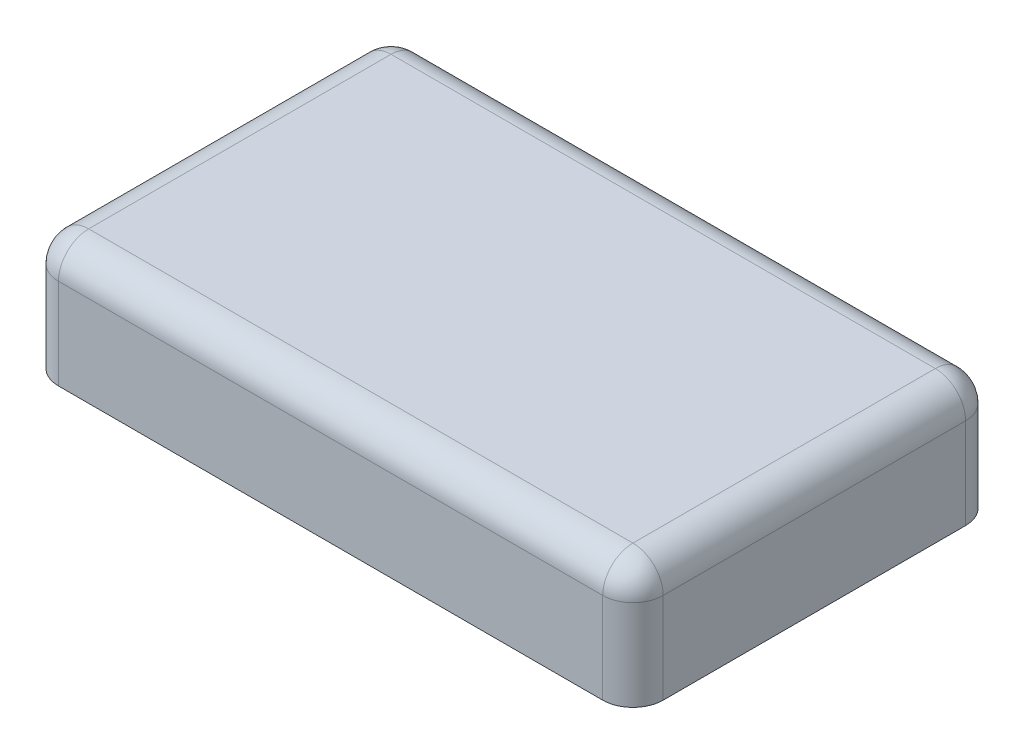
ISO-10303-21;
HEADER;
FILE_DESCRIPTION(('STEP AP214'),'2;1');
FILE_NAME('part.step','',(''),(''),'','','');
FILE_SCHEMA(('AUTOMOTIVE_DESIGN { 1 0 10303 214 1 1 1 1 }'));
ENDSEC;
DATA;
#1=APPLICATION_CONTEXT('core data for automotive mechanical design processes');
#2=APPLICATION_PROTOCOL_DEFINITION('international standard','automotive_design',2000,#1);
#3=PRODUCT_CONTEXT('',#1,'mechanical');
#4=PRODUCT('Part','Part','',(#3));
#5=PRODUCT_RELATED_PRODUCT_CATEGORY('part','',(#4));
#6=PRODUCT_DEFINITION_FORMATION('','',#4);
#7=PRODUCT_DEFINITION_CONTEXT('part definition',#1,'design');
#8=PRODUCT_DEFINITION('design','',#6,#7);
#9=PRODUCT_DEFINITION_SHAPE('','',#8);
#10=(LENGTH_UNIT() NAMED_UNIT(*) SI_UNIT(.MILLI.,.METRE.));
#11=(NAMED_UNIT(*) PLANE_ANGLE_UNIT() SI_UNIT($,.RADIAN.));
#12=(NAMED_UNIT(*) SI_UNIT($,.STERADIAN.) SOLID_ANGLE_UNIT());
#13=UNCERTAINTY_MEASURE_WITH_UNIT(LENGTH_MEASURE(1.E-05),#10,'distance_accuracy_value','');
#14=(GEOMETRIC_REPRESENTATION_CONTEXT(3) GLOBAL_UNCERTAINTY_ASSIGNED_CONTEXT((#13)) GLOBAL_UNIT_ASSIGNED_CONTEXT((#10,
#11,#12)) REPRESENTATION_CONTEXT('',''));
#15=CARTESIAN_POINT('',(0.,0.,0.));
#16=DIRECTION('',(0.,0.,1.));
#17=DIRECTION('',(1.,0.,0.));
#18=AXIS2_PLACEMENT_3D('',#15,#16,#17);
#19=CARTESIAN_POINT('',(63.5,25.4,38.1));
#20=DIRECTION('',(-1.,0.,0.));
#21=DIRECTION('',(0.,0.,1.));
#22=AXIS2_PLACEMENT_3D('',#19,#20,#21);
#23=PLANE('',#22);
#24=DIRECTION('',(0.,-1.,0.));
#25=VECTOR('',#24,1.);
#26=CARTESIAN_POINT('',(63.5,25.4,-31.75));
#27=LINE('',#26,#25);
#28=CARTESIAN_POINT('',(63.5,0.,-31.75));
#29=VERTEX_POINT('',#28);
#30=CARTESIAN_POINT('',(63.5,19.05,-31.75));
#31=VERTEX_POINT('',#30);
#32=EDGE_CURVE('E120',#29,#31,#27,.F.);
#33=ORIENTED_EDGE('',*,*,#32,.T.);
#34=DIRECTION('',(0.,0.,-1.));
#35=VECTOR('',#34,1.);
#36=CARTESIAN_POINT('',(63.5,19.05,38.1));
#37=LINE('',#36,#35);
#38=CARTESIAN_POINT('',(63.5,19.05,31.75));
#39=VERTEX_POINT('',#38);
#40=EDGE_CURVE('E60',#31,#39,#37,.F.);
#41=ORIENTED_EDGE('',*,*,#40,.T.);
#42=DIRECTION('',(0.,-1.,0.));
#43=VECTOR('',#42,1.);
#44=CARTESIAN_POINT('',(63.5,25.4,31.75));
#45=LINE('',#44,#43);
#46=CARTESIAN_POINT('',(63.5,0.,31.75));
#47=VERTEX_POINT('',#46);
#48=EDGE_CURVE('E113',#39,#47,#45,.T.);
#49=ORIENTED_EDGE('',*,*,#48,.T.);
#50=DIRECTION('',(0.,0.,-1.));
#51=VECTOR('',#50,1.);
#52=CARTESIAN_POINT('',(63.5,0.,38.1));
#53=LINE('',#52,#51);
#54=EDGE_CURVE('E116',#47,#29,#53,.T.);
#55=ORIENTED_EDGE('',*,*,#54,.T.);
#56=EDGE_LOOP('',(#33,#41,#49,#55));
#57=FACE_BOUND('',#56,.T.);
#58=ADVANCED_FACE('F36',(#57),#23,.F.);
#59=CARTESIAN_POINT('',(-63.5,25.4,-38.1));
#60=DIRECTION('',(0.,0.,1.));
#61=DIRECTION('',(1.,0.,0.));
#62=AXIS2_PLACEMENT_3D('',#59,#60,#61);
#63=PLANE('',#62);
#64=DIRECTION('',(0.,-1.,0.));
#65=VECTOR('',#64,1.);
#66=CARTESIAN_POINT('',(-57.15,25.4,-38.1));
#67=LINE('',#66,#65);
#68=CARTESIAN_POINT('',(-57.15,0.,-38.1));
#69=VERTEX_POINT('',#68);
#70=CARTESIAN_POINT('',(-57.15,19.05,-38.1));
#71=VERTEX_POINT('',#70);
#72=EDGE_CURVE('E160',#69,#71,#67,.F.);
#73=ORIENTED_EDGE('',*,*,#72,.T.);
#74=DIRECTION('',(-1.,0.,0.));
#75=VECTOR('',#74,1.);
#76=CARTESIAN_POINT('',(-63.5,19.05,-38.1));
#77=LINE('',#76,#75);
#78=CARTESIAN_POINT('',(57.15,19.05,-38.1));
#79=VERTEX_POINT('',#78);
#80=EDGE_CURVE('E179',#71,#79,#77,.F.);
#81=ORIENTED_EDGE('',*,*,#80,.T.);
#82=DIRECTION('',(0.,-1.,0.));
#83=VECTOR('',#82,1.);
#84=CARTESIAN_POINT('',(57.15,25.4,-38.1));
#85=LINE('',#84,#83);
#86=CARTESIAN_POINT('',(57.15,0.,-38.1));
#87=VERTEX_POINT('',#86);
#88=EDGE_CURVE('E158',#79,#87,#85,.T.);
#89=ORIENTED_EDGE('',*,*,#88,.T.);
#90=DIRECTION('',(-1.,0.,0.));
#91=VECTOR('',#90,1.);
#92=CARTESIAN_POINT('',(-63.5,0.,-38.1));
#93=LINE('',#92,#91);
#94=EDGE_CURVE('E135',#87,#69,#93,.T.);
#95=ORIENTED_EDGE('',*,*,#94,.T.);
#96=EDGE_LOOP('',(#73,#81,#89,#95));
#97=FACE_BOUND('',#96,.T.);
#98=ADVANCED_FACE('F238',(#97),#63,.F.);
#99=CARTESIAN_POINT('',(-63.5,25.4,38.1));
#100=DIRECTION('',(1.,0.,0.));
#101=DIRECTION('',(0.,0.,-1.));
#102=AXIS2_PLACEMENT_3D('',#99,#100,#101);
#103=PLANE('',#102);
#104=DIRECTION('',(0.,-1.,0.));
#105=VECTOR('',#104,1.);
#106=CARTESIAN_POINT('',(-63.5,25.4,31.75));
#107=LINE('',#106,#105);
#108=CARTESIAN_POINT('',(-63.5,0.,31.75));
#109=VERTEX_POINT('',#108);
#110=CARTESIAN_POINT('',(-63.5,19.05,31.75));
#111=VERTEX_POINT('',#110);
#112=EDGE_CURVE('E153',#109,#111,#107,.F.);
#113=ORIENTED_EDGE('',*,*,#112,.T.);
#114=DIRECTION('',(0.,0.,1.));
#115=VECTOR('',#114,1.);
#116=CARTESIAN_POINT('',(-63.5,19.05,38.1));
#117=LINE('',#116,#115);
#118=CARTESIAN_POINT('',(-63.5,19.05,-31.75));
#119=VERTEX_POINT('',#118);
#120=EDGE_CURVE('E175',#111,#119,#117,.F.);
#121=ORIENTED_EDGE('',*,*,#120,.T.);
#122=DIRECTION('',(0.,-1.,0.));
#123=VECTOR('',#122,1.);
#124=CARTESIAN_POINT('',(-63.5,25.4,-31.75));
#125=LINE('',#124,#123);
#126=CARTESIAN_POINT('',(-63.5,0.,-31.75));
#127=VERTEX_POINT('',#126);
#128=EDGE_CURVE('E156',#119,#127,#125,.T.);
#129=ORIENTED_EDGE('',*,*,#128,.T.);
#130=DIRECTION('',(0.,0.,1.));
#131=VECTOR('',#130,1.);
#132=CARTESIAN_POINT('',(-63.5,0.,38.1));
#133=LINE('',#132,#131);
#134=EDGE_CURVE('E138',#127,#109,#133,.T.);
#135=ORIENTED_EDGE('',*,*,#134,.T.);
#136=EDGE_LOOP('',(#113,#121,#129,#135));
#137=FACE_BOUND('',#136,.T.);
#138=ADVANCED_FACE('F243',(#137),#103,.F.);
#139=CARTESIAN_POINT('',(-63.5,25.4,38.1));
#140=DIRECTION('',(0.,0.,-1.));
#141=DIRECTION('',(-1.,0.,0.));
#142=AXIS2_PLACEMENT_3D('',#139,#140,#141);
#143=PLANE('',#142);
#144=DIRECTION('',(0.,-1.,0.));
#145=VECTOR('',#144,1.);
#146=CARTESIAN_POINT('',(57.15,25.4,38.1));
#147=LINE('',#146,#145);
#148=CARTESIAN_POINT('',(57.15,0.,38.1));
#149=VERTEX_POINT('',#148);
#150=CARTESIAN_POINT('',(57.15,19.05,38.1));
#151=VERTEX_POINT('',#150);
#152=EDGE_CURVE('E124',#149,#151,#147,.F.);
#153=ORIENTED_EDGE('',*,*,#152,.T.);
#154=DIRECTION('',(1.,0.,0.));
#155=VECTOR('',#154,1.);
#156=CARTESIAN_POINT('',(-63.5,19.05,38.1));
#157=LINE('',#156,#155);
#158=CARTESIAN_POINT('',(-57.15,19.05,38.1));
#159=VERTEX_POINT('',#158);
#160=EDGE_CURVE('E11',#151,#159,#157,.F.);
#161=ORIENTED_EDGE('',*,*,#160,.T.);
#162=DIRECTION('',(0.,-1.,0.));
#163=VECTOR('',#162,1.);
#164=CARTESIAN_POINT('',(-57.15,25.4,38.1));
#165=LINE('',#164,#163);
#166=CARTESIAN_POINT('',(-57.15,0.,38.1));
#167=VERTEX_POINT('',#166);
#168=EDGE_CURVE('E128',#159,#167,#165,.T.);
#169=ORIENTED_EDGE('',*,*,#168,.T.);
#170=DIRECTION('',(1.,0.,0.));
#171=VECTOR('',#170,1.);
#172=CARTESIAN_POINT('',(-63.5,0.,38.1));
#173=LINE('',#172,#171);
#174=EDGE_CURVE('E145',#167,#149,#173,.T.);
#175=ORIENTED_EDGE('',*,*,#174,.T.);
#176=EDGE_LOOP('',(#153,#161,#169,#175));
#177=FACE_BOUND('',#176,.T.);
#178=ADVANCED_FACE('F356',(#177),#143,.F.);
#179=CARTESIAN_POINT('',(0.,25.4,0.));
#180=DIRECTION('',(0.,-1.,0.));
#181=DIRECTION('',(0.,0.,-1.));
#182=AXIS2_PLACEMENT_3D('',#179,#180,#181);
#183=PLANE('',#182);
#184=DIRECTION('',(-1.,0.,0.));
#185=VECTOR('',#184,1.);
#186=CARTESIAN_POINT('',(0.,25.4,-31.75));
#187=LINE('',#186,#185);
#188=CARTESIAN_POINT('',(57.15,25.4,-31.75));
#189=VERTEX_POINT('',#188);
#190=CARTESIAN_POINT('',(-57.15,25.4,-31.75));
#191=VERTEX_POINT('',#190);
#192=EDGE_CURVE('E170',#189,#191,#187,.T.);
#193=ORIENTED_EDGE('',*,*,#192,.T.);
#194=DIRECTION('',(0.,0.,1.));
#195=VECTOR('',#194,1.);
#196=CARTESIAN_POINT('',(-57.15,25.4,0.));
#197=LINE('',#196,#195);
#198=CARTESIAN_POINT('',(-57.15,25.4,31.75));
#199=VERTEX_POINT('',#198);
#200=EDGE_CURVE('E172',#191,#199,#197,.T.);
#201=ORIENTED_EDGE('',*,*,#200,.T.);
#202=DIRECTION('',(1.,0.,0.));
#203=VECTOR('',#202,1.);
#204=CARTESIAN_POINT('',(0.,25.4,31.75));
#205=LINE('',#204,#203);
#206=CARTESIAN_POINT('',(57.15,25.4,31.75));
#207=VERTEX_POINT('',#206);
#208=EDGE_CURVE('E166',#199,#207,#205,.T.);
#209=ORIENTED_EDGE('',*,*,#208,.T.);
#210=DIRECTION('',(0.,0.,-1.));
#211=VECTOR('',#210,1.);
#212=CARTESIAN_POINT('',(57.15,25.4,0.));
#213=LINE('',#212,#211);
#214=EDGE_CURVE('E168',#207,#189,#213,.T.);
#215=ORIENTED_EDGE('',*,*,#214,.T.);
#216=EDGE_LOOP('',(#193,#201,#209,#215));
#217=FACE_BOUND('',#216,.T.);
#218=ADVANCED_FACE('F215',(#217),#183,.F.);
#219=CARTESIAN_POINT('',(0.,0.,0.));
#220=DIRECTION('',(0.,-1.,0.));
#221=DIRECTION('',(0.,0.,-1.));
#222=AXIS2_PLACEMENT_3D('',#219,#220,#221);
#223=PLANE('',#222);
#224=ORIENTED_EDGE('',*,*,#54,.F.);
#225=CARTESIAN_POINT('',(57.15,0.,31.75));
#226=DIRECTION('',(0.,-1.,0.));
#227=DIRECTION('',(0.,0.,-1.));
#228=AXIS2_PLACEMENT_3D('',#225,#226,#227);
#229=CIRCLE('',#228,6.35);
#230=EDGE_CURVE('E122',#47,#149,#229,.T.);
#231=ORIENTED_EDGE('',*,*,#230,.T.);
#232=ORIENTED_EDGE('',*,*,#174,.F.);
#233=CARTESIAN_POINT('',(-57.15,0.,31.75));
#234=DIRECTION('',(0.,-1.,0.));
#235=DIRECTION('',(0.,0.,-1.));
#236=AXIS2_PLACEMENT_3D('',#233,#234,#235);
#237=CIRCLE('',#236,6.35);
#238=EDGE_CURVE('E119',#167,#109,#237,.T.);
#239=ORIENTED_EDGE('',*,*,#238,.T.);
#240=ORIENTED_EDGE('',*,*,#134,.F.);
#241=CARTESIAN_POINT('',(-57.15,0.,-31.75));
#242=DIRECTION('',(0.,-1.,0.));
#243=DIRECTION('',(0.,0.,-1.));
#244=AXIS2_PLACEMENT_3D('',#241,#242,#243);
#245=CIRCLE('',#244,6.35);
#246=EDGE_CURVE('E129',#127,#69,#245,.T.);
#247=ORIENTED_EDGE('',*,*,#246,.T.);
#248=ORIENTED_EDGE('',*,*,#94,.F.);
#249=CARTESIAN_POINT('',(57.15,0.,-31.75));
#250=DIRECTION('',(0.,-1.,0.));
#251=DIRECTION('',(0.,0.,-1.));
#252=AXIS2_PLACEMENT_3D('',#249,#250,#251);
#253=CIRCLE('',#252,6.35);
#254=EDGE_CURVE('E134',#87,#29,#253,.T.);
#255=ORIENTED_EDGE('',*,*,#254,.T.);
#256=EDGE_LOOP('',(#224,#231,#232,#239,#240,#247,#248,#255));
#257=FACE_BOUND('',#256,.T.);
#258=ADVANCED_FACE('F131',(#257),#223,.T.);
#259=CARTESIAN_POINT('',(57.15,25.4,31.75));
#260=DIRECTION('',(0.,-1.,0.));
#261=DIRECTION('',(0.,0.,-1.));
#262=AXIS2_PLACEMENT_3D('',#259,#260,#261);
#263=CYLINDRICAL_SURFACE('',#262,6.35);
#264=ORIENTED_EDGE('',*,*,#48,.F.);
#265=CARTESIAN_POINT('',(57.15,19.05,31.75));
#266=DIRECTION('',(0.,-1.,0.));
#267=DIRECTION('',(0.,0.,-1.));
#268=AXIS2_PLACEMENT_3D('',#265,#266,#267);
#269=CIRCLE('',#268,6.35);
#270=EDGE_CURVE('E45',#39,#151,#269,.T.);
#271=ORIENTED_EDGE('',*,*,#270,.T.);
#272=ORIENTED_EDGE('',*,*,#152,.F.);
#273=ORIENTED_EDGE('',*,*,#230,.F.);
#274=EDGE_LOOP('',(#264,#271,#272,#273));
#275=FACE_BOUND('',#274,.T.);
#276=ADVANCED_FACE('F123',(#275),#263,.T.);
#277=CARTESIAN_POINT('',(-57.15,25.4,-31.75));
#278=DIRECTION('',(0.,-1.,0.));
#279=DIRECTION('',(0.,0.,-1.));
#280=AXIS2_PLACEMENT_3D('',#277,#278,#279);
#281=CYLINDRICAL_SURFACE('',#280,6.35);
#282=ORIENTED_EDGE('',*,*,#128,.F.);
#283=CARTESIAN_POINT('',(-57.15,19.05,-31.75));
#284=DIRECTION('',(0.,-1.,0.));
#285=DIRECTION('',(0.,0.,-1.));
#286=AXIS2_PLACEMENT_3D('',#283,#284,#285);
#287=CIRCLE('',#286,6.35);
#288=EDGE_CURVE('E177',#119,#71,#287,.T.);
#289=ORIENTED_EDGE('',*,*,#288,.T.);
#290=ORIENTED_EDGE('',*,*,#72,.F.);
#291=ORIENTED_EDGE('',*,*,#246,.F.);
#292=EDGE_LOOP('',(#282,#289,#290,#291));
#293=FACE_BOUND('',#292,.T.);
#294=ADVANCED_FACE('F250',(#293),#281,.T.);
#295=CARTESIAN_POINT('',(57.15,25.4,-31.75));
#296=DIRECTION('',(0.,-1.,0.));
#297=DIRECTION('',(0.,0.,-1.));
#298=AXIS2_PLACEMENT_3D('',#295,#296,#297);
#299=CYLINDRICAL_SURFACE('',#298,6.35);
#300=ORIENTED_EDGE('',*,*,#88,.F.);
#301=CARTESIAN_POINT('',(57.15,19.05,-31.75));
#302=DIRECTION('',(0.,-1.,0.));
#303=DIRECTION('',(0.,0.,-1.));
#304=AXIS2_PLACEMENT_3D('',#301,#302,#303);
#305=CIRCLE('',#304,6.35);
#306=EDGE_CURVE('E181',#79,#31,#305,.T.);
#307=ORIENTED_EDGE('',*,*,#306,.T.);
#308=ORIENTED_EDGE('',*,*,#32,.F.);
#309=ORIENTED_EDGE('',*,*,#254,.F.);
#310=EDGE_LOOP('',(#300,#307,#308,#309));
#311=FACE_BOUND('',#310,.T.);
#312=ADVANCED_FACE('F253',(#311),#299,.T.);
#313=CARTESIAN_POINT('',(-57.15,25.4,31.75));
#314=DIRECTION('',(0.,-1.,0.));
#315=DIRECTION('',(0.,0.,-1.));
#316=AXIS2_PLACEMENT_3D('',#313,#314,#315);
#317=CYLINDRICAL_SURFACE('',#316,6.35);
#318=ORIENTED_EDGE('',*,*,#168,.F.);
#319=CARTESIAN_POINT('',(-57.15,19.05,31.75));
#320=DIRECTION('',(0.,-1.,0.));
#321=DIRECTION('',(0.,0.,-1.));
#322=AXIS2_PLACEMENT_3D('',#319,#320,#321);
#323=CIRCLE('',#322,6.35);
#324=EDGE_CURVE('E163',#159,#111,#323,.T.);
#325=ORIENTED_EDGE('',*,*,#324,.T.);
#326=ORIENTED_EDGE('',*,*,#112,.F.);
#327=ORIENTED_EDGE('',*,*,#238,.F.);
#328=EDGE_LOOP('',(#318,#325,#326,#327));
#329=FACE_BOUND('',#328,.T.);
#330=ADVANCED_FACE('F257',(#329),#317,.T.);
#331=CARTESIAN_POINT('',(57.15,19.05,-31.75));
#332=DIRECTION('',(0.,-1.,0.));
#333=DIRECTION('',(0.,0.,-1.));
#334=AXIS2_PLACEMENT_3D('',#331,#332,#333);
#335=SPHERICAL_SURFACE('',#334,6.35);
#336=CARTESIAN_POINT('',(57.15,19.05,-31.75));
#337=DIRECTION('',(0.,0.,1.));
#338=DIRECTION('',(1.,0.,0.));
#339=AXIS2_PLACEMENT_3D('',#336,#337,#338);
#340=CIRCLE('',#339,6.35);
#341=EDGE_CURVE('E141',#31,#189,#340,.T.);
#342=ORIENTED_EDGE('',*,*,#341,.F.);
#343=ORIENTED_EDGE('',*,*,#306,.F.);
#344=CARTESIAN_POINT('',(57.15,19.05,-31.75));
#345=DIRECTION('',(-1.,0.,0.));
#346=DIRECTION('',(0.,0.,1.));
#347=AXIS2_PLACEMENT_3D('',#344,#345,#346);
#348=CIRCLE('',#347,6.35);
#349=EDGE_CURVE('E40',#189,#79,#348,.T.);
#350=ORIENTED_EDGE('',*,*,#349,.F.);
#351=EDGE_LOOP('',(#342,#343,#350));
#352=FACE_BOUND('',#351,.T.);
#353=ADVANCED_FACE('F38',(#352),#335,.T.);
#354=CARTESIAN_POINT('',(0.,19.05,-31.75));
#355=DIRECTION('',(-1.,0.,0.));
#356=DIRECTION('',(0.,0.,1.));
#357=AXIS2_PLACEMENT_3D('',#354,#355,#356);
#358=CYLINDRICAL_SURFACE('',#357,6.35);
#359=ORIENTED_EDGE('',*,*,#349,.T.);
#360=ORIENTED_EDGE('',*,*,#80,.F.);
#361=CARTESIAN_POINT('',(-57.15,19.05,-31.75));
#362=DIRECTION('',(-1.,0.,0.));
#363=DIRECTION('',(0.,0.,1.));
#364=AXIS2_PLACEMENT_3D('',#361,#362,#363);
#365=CIRCLE('',#364,6.35);
#366=EDGE_CURVE('E198',#191,#71,#365,.T.);
#367=ORIENTED_EDGE('',*,*,#366,.F.);
#368=ORIENTED_EDGE('',*,*,#192,.F.);
#369=EDGE_LOOP('',(#359,#360,#367,#368));
#370=FACE_BOUND('',#369,.T.);
#371=ADVANCED_FACE('F212',(#370),#358,.T.);
#372=CARTESIAN_POINT('',(57.15,19.05,0.));
#373=DIRECTION('',(0.,0.,-1.));
#374=DIRECTION('',(-1.,0.,0.));
#375=AXIS2_PLACEMENT_3D('',#372,#373,#374);
#376=CYLINDRICAL_SURFACE('',#375,6.35);
#377=ORIENTED_EDGE('',*,*,#341,.T.);
#378=ORIENTED_EDGE('',*,*,#214,.F.);
#379=CARTESIAN_POINT('',(57.15,19.05,31.75));
#380=DIRECTION('',(0.,0.,1.));
#381=DIRECTION('',(1.,0.,0.));
#382=AXIS2_PLACEMENT_3D('',#379,#380,#381);
#383=CIRCLE('',#382,6.35);
#384=EDGE_CURVE('E195',#39,#207,#383,.T.);
#385=ORIENTED_EDGE('',*,*,#384,.F.);
#386=ORIENTED_EDGE('',*,*,#40,.F.);
#387=EDGE_LOOP('',(#377,#378,#385,#386));
#388=FACE_BOUND('',#387,.T.);
#389=ADVANCED_FACE('F205',(#388),#376,.T.);
#390=CARTESIAN_POINT('',(-57.15,19.05,-31.75));
#391=DIRECTION('',(0.,-1.,0.));
#392=DIRECTION('',(0.,0.,-1.));
#393=AXIS2_PLACEMENT_3D('',#390,#391,#392);
#394=SPHERICAL_SURFACE('',#393,6.35);
#395=ORIENTED_EDGE('',*,*,#366,.T.);
#396=ORIENTED_EDGE('',*,*,#288,.F.);
#397=CARTESIAN_POINT('',(-57.15,19.05,-31.75));
#398=DIRECTION('',(0.,0.,1.));
#399=DIRECTION('',(1.,0.,0.));
#400=AXIS2_PLACEMENT_3D('',#397,#398,#399);
#401=CIRCLE('',#400,6.35);
#402=EDGE_CURVE('E192',#191,#119,#401,.T.);
#403=ORIENTED_EDGE('',*,*,#402,.F.);
#404=EDGE_LOOP('',(#395,#396,#403));
#405=FACE_BOUND('',#404,.T.);
#406=ADVANCED_FACE('F227',(#405),#394,.T.);
#407=CARTESIAN_POINT('',(57.15,19.05,31.75));
#408=DIRECTION('',(0.,-1.,0.));
#409=DIRECTION('',(0.,0.,-1.));
#410=AXIS2_PLACEMENT_3D('',#407,#408,#409);
#411=SPHERICAL_SURFACE('',#410,6.35);
#412=ORIENTED_EDGE('',*,*,#270,.F.);
#413=ORIENTED_EDGE('',*,*,#384,.T.);
#414=CARTESIAN_POINT('',(57.15,19.05,31.75));
#415=DIRECTION('',(-1.,0.,0.));
#416=DIRECTION('',(0.,0.,1.));
#417=AXIS2_PLACEMENT_3D('',#414,#415,#416);
#418=CIRCLE('',#417,6.35);
#419=EDGE_CURVE('E189',#151,#207,#418,.T.);
#420=ORIENTED_EDGE('',*,*,#419,.F.);
#421=EDGE_LOOP('',(#412,#413,#420));
#422=FACE_BOUND('',#421,.T.);
#423=ADVANCED_FACE('F224',(#422),#411,.T.);
#424=CARTESIAN_POINT('',(-57.15,19.05,0.));
#425=DIRECTION('',(0.,0.,1.));
#426=DIRECTION('',(1.,0.,0.));
#427=AXIS2_PLACEMENT_3D('',#424,#425,#426);
#428=CYLINDRICAL_SURFACE('',#427,6.35);
#429=ORIENTED_EDGE('',*,*,#402,.T.);
#430=ORIENTED_EDGE('',*,*,#120,.F.);
#431=CARTESIAN_POINT('',(-57.15,19.05,31.75));
#432=DIRECTION('',(0.,0.,1.));
#433=DIRECTION('',(1.,0.,0.));
#434=AXIS2_PLACEMENT_3D('',#431,#432,#433);
#435=CIRCLE('',#434,6.35);
#436=EDGE_CURVE('E187',#199,#111,#435,.T.);
#437=ORIENTED_EDGE('',*,*,#436,.F.);
#438=ORIENTED_EDGE('',*,*,#200,.F.);
#439=EDGE_LOOP('',(#429,#430,#437,#438));
#440=FACE_BOUND('',#439,.T.);
#441=ADVANCED_FACE('F226',(#440),#428,.T.);
#442=CARTESIAN_POINT('',(0.,19.05,31.75));
#443=DIRECTION('',(1.,0.,0.));
#444=DIRECTION('',(0.,0.,-1.));
#445=AXIS2_PLACEMENT_3D('',#442,#443,#444);
#446=CYLINDRICAL_SURFACE('',#445,6.35);
#447=ORIENTED_EDGE('',*,*,#419,.T.);
#448=ORIENTED_EDGE('',*,*,#208,.F.);
#449=CARTESIAN_POINT('',(-57.15,19.05,31.75));
#450=DIRECTION('',(-1.,0.,0.));
#451=DIRECTION('',(0.,0.,1.));
#452=AXIS2_PLACEMENT_3D('',#449,#450,#451);
#453=CIRCLE('',#452,6.35);
#454=EDGE_CURVE('E185',#159,#199,#453,.T.);
#455=ORIENTED_EDGE('',*,*,#454,.F.);
#456=ORIENTED_EDGE('',*,*,#160,.F.);
#457=EDGE_LOOP('',(#447,#448,#455,#456));
#458=FACE_BOUND('',#457,.T.);
#459=ADVANCED_FACE('F220',(#458),#446,.T.);
#460=CARTESIAN_POINT('',(-57.15,19.05,31.75));
#461=DIRECTION('',(0.,-1.,0.));
#462=DIRECTION('',(0.,0.,-1.));
#463=AXIS2_PLACEMENT_3D('',#460,#461,#462);
#464=SPHERICAL_SURFACE('',#463,6.35);
#465=ORIENTED_EDGE('',*,*,#436,.T.);
#466=ORIENTED_EDGE('',*,*,#324,.F.);
#467=ORIENTED_EDGE('',*,*,#454,.T.);
#468=EDGE_LOOP('',(#465,#466,#467));
#469=FACE_BOUND('',#468,.T.);
#470=ADVANCED_FACE('F262',(#469),#464,.T.);
#471=CLOSED_SHELL('',(#58,#98,#138,#178,#218,#258,#276,#294,#312,#330,#353,#371,#389,#406,#423,
#441,#459,#470));
#472=MANIFOLD_SOLID_BREP('B2',#471);
#473=ADVANCED_BREP_SHAPE_REPRESENTATION('',(#18,#472),#14);
#474=SHAPE_DEFINITION_REPRESENTATION(#9,#473);
ENDSEC;
END-ISO-10303-21;
